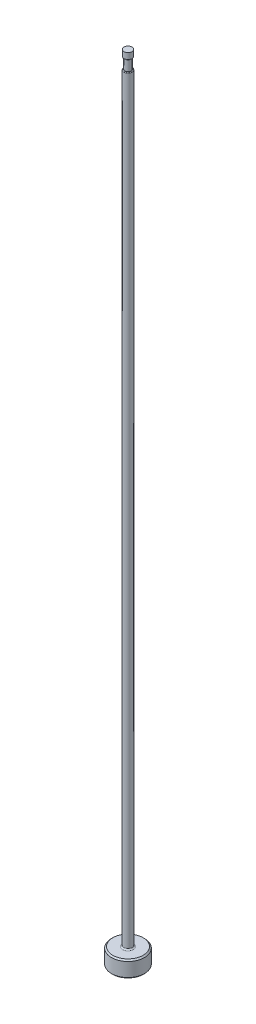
ISO-10303-21;
HEADER;
FILE_DESCRIPTION(('STEP AP214'),'2;1');
FILE_NAME('part.step','',(''),(''),'','','');
FILE_SCHEMA(('AUTOMOTIVE_DESIGN { 1 0 10303 214 1 1 1 1 }'));
ENDSEC;
DATA;
#1=APPLICATION_CONTEXT('core data for automotive mechanical design processes');
#2=APPLICATION_PROTOCOL_DEFINITION('international standard','automotive_design',2000,#1);
#3=PRODUCT_CONTEXT('',#1,'mechanical');
#4=PRODUCT('Part','Part','',(#3));
#5=PRODUCT_RELATED_PRODUCT_CATEGORY('part','',(#4));
#6=PRODUCT_DEFINITION_FORMATION('','',#4);
#7=PRODUCT_DEFINITION_CONTEXT('part definition',#1,'design');
#8=PRODUCT_DEFINITION('design','',#6,#7);
#9=PRODUCT_DEFINITION_SHAPE('','',#8);
#10=(LENGTH_UNIT() NAMED_UNIT(*) SI_UNIT(.MILLI.,.METRE.));
#11=(NAMED_UNIT(*) PLANE_ANGLE_UNIT() SI_UNIT($,.RADIAN.));
#12=(NAMED_UNIT(*) SI_UNIT($,.STERADIAN.) SOLID_ANGLE_UNIT());
#13=UNCERTAINTY_MEASURE_WITH_UNIT(LENGTH_MEASURE(1.E-05),#10,'distance_accuracy_value','');
#14=(GEOMETRIC_REPRESENTATION_CONTEXT(3) GLOBAL_UNCERTAINTY_ASSIGNED_CONTEXT((#13)) GLOBAL_UNIT_ASSIGNED_CONTEXT((#10,
#11,#12)) REPRESENTATION_CONTEXT('',''));
#15=CARTESIAN_POINT('',(0.,0.,0.));
#16=DIRECTION('',(0.,0.,1.));
#17=DIRECTION('',(1.,0.,0.));
#18=AXIS2_PLACEMENT_3D('',#15,#16,#17);
#19=CARTESIAN_POINT('',(-0.793749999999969,151.13,0.));
#20=DIRECTION('',(0.,1.,0.));
#21=DIRECTION('',(0.,0.,1.));
#22=AXIS2_PLACEMENT_3D('',#19,#20,#21);
#23=PLANE('',#22);
#24=CARTESIAN_POINT('',(0.,151.13,0.));
#25=DIRECTION('',(0.,1.,0.));
#26=DIRECTION('',(0.,0.,1.));
#27=AXIS2_PLACEMENT_3D('',#24,#25,#26);
#28=CIRCLE('',#27,0.647699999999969);
#29=CARTESIAN_POINT('',(0.,151.13,0.647699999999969));
#30=VERTEX_POINT('',#29);
#31=EDGE_CURVE('E11',#30,#30,#28,.F.);
#32=ORIENTED_EDGE('',*,*,#31,.T.);
#33=EDGE_LOOP('',(#32));
#34=FACE_BOUND('',#33,.T.);
#35=CARTESIAN_POINT('',(0.,151.13,0.));
#36=DIRECTION('',(0.,1.,0.));
#37=DIRECTION('',(0.,0.,1.));
#38=AXIS2_PLACEMENT_3D('',#35,#36,#37);
#39=CIRCLE('',#38,0.590549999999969);
#40=CARTESIAN_POINT('',(0.,151.13,0.590549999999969));
#41=VERTEX_POINT('',#40);
#42=EDGE_CURVE('E78',#41,#41,#39,.T.);
#43=ORIENTED_EDGE('',*,*,#42,.T.);
#44=EDGE_LOOP('',(#43));
#45=FACE_BOUND('',#44,.T.);
#46=ADVANCED_FACE('F36',(#34,#45),#23,.F.);
#47=CARTESIAN_POINT('',(0.,259.958771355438,0.));
#48=DIRECTION('',(0.,1.,0.));
#49=DIRECTION('',(0.,0.,1.));
#50=AXIS2_PLACEMENT_3D('',#47,#48,#49);
#51=CYLINDRICAL_SURFACE('',#50,0.793749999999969);
#52=DIRECTION('',(0.,1.,0.));
#53=VECTOR('',#52,1.);
#54=CARTESIAN_POINT('',(-0.590549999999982,259.958771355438,-0.530367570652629));
#55=LINE('',#54,#53);
#56=CARTESIAN_POINT('',(-0.590549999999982,148.971,-0.530367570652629));
#57=VERTEX_POINT('',#56);
#58=CARTESIAN_POINT('',(-0.590549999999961,86.614,-0.530367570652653));
#59=VERTEX_POINT('',#58);
#60=EDGE_CURVE('E73',#57,#59,#55,.F.);
#61=ORIENTED_EDGE('',*,*,#60,.F.);
#62=CARTESIAN_POINT('',(0.,148.971,0.));
#63=DIRECTION('',(0.,-1.,0.));
#64=DIRECTION('',(0.,0.,-1.));
#65=AXIS2_PLACEMENT_3D('',#62,#63,#64);
#66=CIRCLE('',#65,0.793749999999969);
#67=CARTESIAN_POINT('',(-0.590549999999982,148.971,0.530367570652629));
#68=VERTEX_POINT('',#67);
#69=EDGE_CURVE('E51',#57,#68,#66,.T.);
#70=ORIENTED_EDGE('',*,*,#69,.T.);
#71=DIRECTION('',(0.,1.,0.));
#72=VECTOR('',#71,1.);
#73=CARTESIAN_POINT('',(-0.590549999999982,259.958771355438,0.530367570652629));
#74=LINE('',#73,#72);
#75=CARTESIAN_POINT('',(-0.590549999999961,86.614,0.530367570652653));
#76=VERTEX_POINT('',#75);
#77=EDGE_CURVE('E84',#76,#68,#74,.T.);
#78=ORIENTED_EDGE('',*,*,#77,.F.);
#79=CARTESIAN_POINT('',(-0.590549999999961,86.614,-0.530367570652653));
#80=CARTESIAN_POINT('',(-0.59053917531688,86.5581966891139,-0.530314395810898));
#81=CARTESIAN_POINT('',(-0.592020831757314,86.5023728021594,-0.528725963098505));
#82=CARTESIAN_POINT('',(-0.597911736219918,86.3908205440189,-0.522091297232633));
#83=CARTESIAN_POINT('',(-0.602334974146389,86.3350939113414,-0.517028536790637));
#84=CARTESIAN_POINT('',(-0.614284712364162,86.2222022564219,-0.502771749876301));
#85=CARTESIAN_POINT('',(-0.621928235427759,86.1650688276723,-0.493420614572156));
#86=CARTESIAN_POINT('',(-0.640090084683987,86.0524288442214,-0.469629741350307));
#87=CARTESIAN_POINT('',(-0.650601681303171,85.9969188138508,-0.455201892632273));
#88=CARTESIAN_POINT('',(-0.672694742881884,85.8947751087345,-0.421752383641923));
#89=CARTESIAN_POINT('',(-0.684015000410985,85.8478538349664,-0.403447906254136));
#90=CARTESIAN_POINT('',(-0.707793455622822,85.7579254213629,-0.360113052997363));
#91=CARTESIAN_POINT('',(-0.720238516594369,85.7148824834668,-0.335155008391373));
#92=CARTESIAN_POINT('',(-0.738199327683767,85.6568429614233,-0.292081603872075));
#93=CARTESIAN_POINT('',(-0.743831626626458,85.6392421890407,-0.277537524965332));
#94=CARTESIAN_POINT('',(-0.754779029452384,85.6059385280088,-0.246220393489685));
#95=CARTESIAN_POINT('',(-0.760093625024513,85.5902386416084,-0.229443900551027));
#96=CARTESIAN_POINT('',(-0.770096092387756,85.5613279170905,-0.193256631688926));
#97=CARTESIAN_POINT('',(-0.774774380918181,85.5481541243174,-0.173812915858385));
#98=CARTESIAN_POINT('',(-0.782879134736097,85.525678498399,-0.132572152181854));
#99=CARTESIAN_POINT('',(-0.786309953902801,85.5163631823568,-0.110783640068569));
#100=CARTESIAN_POINT('',(-0.790553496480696,85.5049260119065,-0.0728220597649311));
#101=CARTESIAN_POINT('',(-0.791853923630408,85.5014525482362,-0.0571082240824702));
#102=CARTESIAN_POINT('',(-0.793506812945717,85.4970442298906,-0.02527858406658));
#103=CARTESIAN_POINT('',(-0.79385989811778,85.4961077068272,-0.00916305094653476));
#104=CARTESIAN_POINT('',(-0.79357975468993,85.4968527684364,0.0230049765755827));
#105=CARTESIAN_POINT('',(-0.792946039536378,85.4985356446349,0.0390574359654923));
#106=CARTESIAN_POINT('',(-0.790759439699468,85.5043804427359,0.0706385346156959));
#107=CARTESIAN_POINT('',(-0.789205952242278,85.5085439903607,0.086166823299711));
#108=CARTESIAN_POINT('',(-0.78484716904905,85.5203438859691,0.120053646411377));
#109=CARTESIAN_POINT('',(-0.781828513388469,85.5285809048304,0.138174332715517));
#110=CARTESIAN_POINT('',(-0.774926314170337,85.5477453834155,0.172744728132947));
#111=CARTESIAN_POINT('',(-0.77104126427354,85.5586775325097,0.189191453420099));
#112=CARTESIAN_POINT('',(-0.760742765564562,85.5882791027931,0.227766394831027));
#113=CARTESIAN_POINT('',(-0.754005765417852,85.6081551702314,0.248875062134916));
#114=CARTESIAN_POINT('',(-0.740079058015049,85.6508481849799,0.287657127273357));
#115=CARTESIAN_POINT('',(-0.732888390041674,85.6736714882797,0.305322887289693));
#116=CARTESIAN_POINT('',(-0.713188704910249,85.7390259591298,0.349810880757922));
#117=CARTESIAN_POINT('',(-0.700707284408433,85.7835752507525,0.373653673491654));
#118=CARTESIAN_POINT('',(-0.677153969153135,85.8759372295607,0.414797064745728));
#119=CARTESIAN_POINT('',(-0.666086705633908,85.9237598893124,0.432076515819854));
#120=CARTESIAN_POINT('',(-0.646811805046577,86.0171939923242,0.460367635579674));
#121=CARTESIAN_POINT('',(-0.638441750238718,86.0626519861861,0.4717848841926));
#122=CARTESIAN_POINT('',(-0.623612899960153,86.1546203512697,0.491217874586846));
#123=CARTESIAN_POINT('',(-0.617155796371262,86.2011316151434,0.499230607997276));
#124=CARTESIAN_POINT('',(-0.606291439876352,86.2947368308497,0.512368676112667));
#125=CARTESIAN_POINT('',(-0.601882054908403,86.3418301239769,0.517497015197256));
#126=CARTESIAN_POINT('',(-0.59516857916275,86.4363714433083,0.525204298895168));
#127=CARTESIAN_POINT('',(-0.592864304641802,86.4838194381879,0.527783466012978));
#128=CARTESIAN_POINT('',(-0.591267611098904,86.5451029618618,0.529567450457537));
#129=CARTESIAN_POINT('',(-0.590998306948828,86.5588916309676,0.52986795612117));
#130=CARTESIAN_POINT('',(-0.590639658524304,86.586453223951,0.530267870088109));
#131=CARTESIAN_POINT('',(-0.59055004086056,86.6002261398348,0.530367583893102));
#132=CARTESIAN_POINT('',(-0.59054999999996,86.6139999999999,0.530367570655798));
#133=B_SPLINE_CURVE_WITH_KNOTS('',3,(#79,#80,#81,#82,#83,#84,#85,#86,#87,#88,#89,#90,#91,#92,
#93,#94,#95,#96,#97,#98,#99,#100,#101,#102,#103,#104,#105,#106,#107,#108,#109,#110,#111,#112,
#113,#114,#115,#116,#117,#118,#119,#120,#121,#122,#123,#124,#125,#126,#127,#128,#129,#130,#131,
#132),.UNSPECIFIED.,.F.,.F.,(4,2,2,2,2,2,2,2,2,2,2,2,2,2,2,2,2,2,2,2,2,2,2,2,2,2,4),(0.,
0.167401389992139,0.335604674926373,0.510534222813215,0.68505679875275,0.839551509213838,
0.992430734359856,1.0628421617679,1.13336338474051,1.20485071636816,1.27608609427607,
1.32431373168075,1.3725096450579,1.42072932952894,1.46898064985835,1.52904518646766,
1.5892149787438,1.67801053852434,1.76700089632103,1.92226871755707,2.0780326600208,
2.22066560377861,2.3634243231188,2.50603406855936,2.6486313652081,2.69001340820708,
2.73133244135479),.UNSPECIFIED.);
#134=EDGE_CURVE('E81',#59,#76,#133,.T.);
#135=ORIENTED_EDGE('',*,*,#134,.F.);
#136=EDGE_LOOP('',(#61,#70,#78,#135));
#137=FACE_BOUND('',#136,.T.);
#138=CARTESIAN_POINT('',(0.,3.42900000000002,0.));
#139=DIRECTION('',(0.,1.,0.));
#140=DIRECTION('',(0.,0.,1.));
#141=AXIS2_PLACEMENT_3D('',#138,#139,#140);
#142=CIRCLE('',#141,0.793749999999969);
#143=CARTESIAN_POINT('',(0.,3.42900000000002,0.793749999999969));
#144=VERTEX_POINT('',#143);
#145=EDGE_CURVE('E116',#144,#144,#142,.T.);
#146=ORIENTED_EDGE('',*,*,#145,.T.);
#147=EDGE_LOOP('',(#146));
#148=FACE_BOUND('',#147,.T.);
#149=ADVANCED_FACE('F82',(#137,#148),#51,.T.);
#150=CARTESIAN_POINT('',(0.,0.,0.));
#151=DIRECTION('',(0.,-1.,0.));
#152=DIRECTION('',(0.,0.,-1.));
#153=AXIS2_PLACEMENT_3D('',#150,#151,#152);
#154=PLANE('',#153);
#155=CARTESIAN_POINT('',(0.,0.,0.));
#156=DIRECTION('',(0.,-1.,0.));
#157=DIRECTION('',(0.,0.,-1.));
#158=AXIS2_PLACEMENT_3D('',#155,#156,#157);
#159=CIRCLE('',#158,2.92099999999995);
#160=CARTESIAN_POINT('',(0.,0.,-2.92099999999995));
#161=VERTEX_POINT('',#160);
#162=EDGE_CURVE('E113',#161,#161,#159,.T.);
#163=ORIENTED_EDGE('',*,*,#162,.T.);
#164=EDGE_LOOP('',(#163));
#165=FACE_BOUND('',#164,.T.);
#166=ADVANCED_FACE('F192',(#165),#154,.T.);
#167=CARTESIAN_POINT('',(0.,259.958771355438,0.));
#168=DIRECTION('',(0.,1.,0.));
#169=DIRECTION('',(0.,0.,1.));
#170=AXIS2_PLACEMENT_3D('',#167,#168,#169);
#171=CYLINDRICAL_SURFACE('',#170,3.17499999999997);
#172=CARTESIAN_POINT('',(0.,2.92100000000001,0.));
#173=DIRECTION('',(0.,1.,0.));
#174=DIRECTION('',(0.,0.,1.));
#175=AXIS2_PLACEMENT_3D('',#172,#173,#174);
#176=CIRCLE('',#175,3.17499999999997);
#177=CARTESIAN_POINT('',(0.,2.92100000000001,3.17499999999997));
#178=VERTEX_POINT('',#177);
#179=EDGE_CURVE('E110',#178,#178,#176,.F.);
#180=ORIENTED_EDGE('',*,*,#179,.T.);
#181=EDGE_LOOP('',(#180));
#182=FACE_BOUND('',#181,.T.);
#183=CARTESIAN_POINT('',(0.,0.254000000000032,0.));
#184=DIRECTION('',(0.,-1.,0.));
#185=DIRECTION('',(0.,0.,-1.));
#186=AXIS2_PLACEMENT_3D('',#183,#184,#185);
#187=CIRCLE('',#186,3.17499999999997);
#188=CARTESIAN_POINT('',(0.,0.254000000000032,-3.17499999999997));
#189=VERTEX_POINT('',#188);
#190=EDGE_CURVE('E107',#189,#189,#187,.F.);
#191=ORIENTED_EDGE('',*,*,#190,.T.);
#192=EDGE_LOOP('',(#191));
#193=FACE_BOUND('',#192,.T.);
#194=ADVANCED_FACE('F195',(#182,#193),#171,.T.);
#195=CARTESIAN_POINT('',(-3.17499999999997,3.175,0.));
#196=DIRECTION('',(0.,1.,0.));
#197=DIRECTION('',(0.,0.,1.));
#198=AXIS2_PLACEMENT_3D('',#195,#196,#197);
#199=PLANE('',#198);
#200=CARTESIAN_POINT('',(0.,3.175,0.));
#201=DIRECTION('',(0.,1.,0.));
#202=DIRECTION('',(0.,0.,1.));
#203=AXIS2_PLACEMENT_3D('',#200,#201,#202);
#204=CIRCLE('',#203,1.04774999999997);
#205=CARTESIAN_POINT('',(0.,3.175,1.04774999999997));
#206=VERTEX_POINT('',#205);
#207=EDGE_CURVE('E87',#206,#206,#204,.F.);
#208=ORIENTED_EDGE('',*,*,#207,.T.);
#209=EDGE_LOOP('',(#208));
#210=FACE_BOUND('',#209,.T.);
#211=CARTESIAN_POINT('',(0.,3.175,0.));
#212=DIRECTION('',(0.,1.,0.));
#213=DIRECTION('',(0.,0.,1.));
#214=AXIS2_PLACEMENT_3D('',#211,#212,#213);
#215=CIRCLE('',#214,2.92099999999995);
#216=CARTESIAN_POINT('',(0.,3.175,2.92099999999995));
#217=VERTEX_POINT('',#216);
#218=EDGE_CURVE('E104',#217,#217,#215,.T.);
#219=ORIENTED_EDGE('',*,*,#218,.T.);
#220=EDGE_LOOP('',(#219));
#221=FACE_BOUND('',#220,.T.);
#222=ADVANCED_FACE('F190',(#210,#221),#199,.T.);
#223=CARTESIAN_POINT('',(0.,3.17499999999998,0.));
#224=DIRECTION('',(0.,-1.,0.));
#225=DIRECTION('',(0.,0.,-1.));
#226=AXIS2_PLACEMENT_3D('',#223,#224,#225);
#227=CONICAL_SURFACE('',#226,2.92099999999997,0.7853981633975);
#228=ORIENTED_EDGE('',*,*,#179,.F.);
#229=EDGE_LOOP('',(#228));
#230=FACE_BOUND('',#229,.T.);
#231=ORIENTED_EDGE('',*,*,#218,.F.);
#232=EDGE_LOOP('',(#231));
#233=FACE_BOUND('',#232,.T.);
#234=ADVANCED_FACE('F186',(#230,#233),#227,.T.);
#235=CARTESIAN_POINT('',(0.,0.254000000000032,0.));
#236=DIRECTION('',(0.,1.,0.));
#237=DIRECTION('',(0.,0.,1.));
#238=AXIS2_PLACEMENT_3D('',#235,#236,#237);
#239=CONICAL_SURFACE('',#238,3.17499999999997,0.785398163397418);
#240=ORIENTED_EDGE('',*,*,#162,.F.);
#241=EDGE_LOOP('',(#240));
#242=FACE_BOUND('',#241,.T.);
#243=ORIENTED_EDGE('',*,*,#190,.F.);
#244=EDGE_LOOP('',(#243));
#245=FACE_BOUND('',#244,.T.);
#246=ADVANCED_FACE('F182',(#242,#245),#239,.T.);
#247=CARTESIAN_POINT('',(0.,3.42900000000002,0.));
#248=DIRECTION('',(0.,1.,0.));
#249=DIRECTION('',(0.,0.,1.));
#250=AXIS2_PLACEMENT_3D('',#247,#248,#249);
#251=TOROIDAL_SURFACE('',#250,1.04774999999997,0.254);
#252=ORIENTED_EDGE('',*,*,#207,.F.);
#253=EDGE_LOOP('',(#252));
#254=FACE_BOUND('',#253,.T.);
#255=ORIENTED_EDGE('',*,*,#145,.F.);
#256=EDGE_LOOP('',(#255));
#257=FACE_BOUND('',#256,.T.);
#258=ADVANCED_FACE('F147',(#254,#257),#251,.F.);
#259=CARTESIAN_POINT('',(-0.793749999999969,149.098,0.));
#260=DIRECTION('',(0.,-1.,0.));
#261=DIRECTION('',(0.,0.,-1.));
#262=AXIS2_PLACEMENT_3D('',#259,#260,#261);
#263=PLANE('',#262);
#264=DIRECTION('',(0.,0.,1.));
#265=VECTOR('',#264,1.);
#266=CARTESIAN_POINT('',(-0.590549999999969,149.098,0.));
#267=LINE('',#266,#265);
#268=CARTESIAN_POINT('',(-0.590549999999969,149.098,0.));
#269=VERTEX_POINT('',#268);
#270=CARTESIAN_POINT('',(-0.590549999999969,149.098,0.309525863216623));
#271=VERTEX_POINT('',#270);
#272=EDGE_CURVE('E90',#269,#271,#267,.T.);
#273=ORIENTED_EDGE('',*,*,#272,.T.);
#274=CARTESIAN_POINT('',(0.,149.098,0.));
#275=DIRECTION('',(0.,-1.,0.));
#276=DIRECTION('',(0.,0.,-1.));
#277=AXIS2_PLACEMENT_3D('',#274,#275,#276);
#278=CIRCLE('',#277,0.666749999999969);
#279=CARTESIAN_POINT('',(-0.590549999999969,149.098,-0.309525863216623));
#280=VERTEX_POINT('',#279);
#281=EDGE_CURVE('E86',#271,#280,#278,.F.);
#282=ORIENTED_EDGE('',*,*,#281,.T.);
#283=EDGE_CURVE('E79',#280,#269,#267,.T.);
#284=ORIENTED_EDGE('',*,*,#283,.T.);
#285=CARTESIAN_POINT('',(0.,149.098,0.));
#286=DIRECTION('',(0.,1.,0.));
#287=DIRECTION('',(0.,0.,1.));
#288=AXIS2_PLACEMENT_3D('',#285,#286,#287);
#289=CIRCLE('',#288,0.590549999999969);
#290=EDGE_CURVE('E101',#269,#269,#289,.T.);
#291=ORIENTED_EDGE('',*,*,#290,.F.);
#292=EDGE_LOOP('',(#273,#282,#284,#291));
#293=FACE_BOUND('',#292,.T.);
#294=ADVANCED_FACE('F144',(#293),#263,.F.);
#295=CARTESIAN_POINT('',(0.,153.448281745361,0.));
#296=DIRECTION('',(0.,1.,0.));
#297=DIRECTION('',(0.,0.,1.));
#298=AXIS2_PLACEMENT_3D('',#295,#296,#297);
#299=CYLINDRICAL_SURFACE('',#298,0.590549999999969);
#300=ORIENTED_EDGE('',*,*,#42,.F.);
#301=EDGE_LOOP('',(#300));
#302=FACE_BOUND('',#301,.T.);
#303=ORIENTED_EDGE('',*,*,#290,.T.);
#304=EDGE_LOOP('',(#303));
#305=FACE_BOUND('',#304,.T.);
#306=ADVANCED_FACE('F141',(#302,#305),#299,.T.);
#307=CARTESIAN_POINT('',(-0.590549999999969,150.114,-3.17499999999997));
#308=DIRECTION('',(1.,0.,0.));
#309=DIRECTION('',(0.,1.,0.));
#310=AXIS2_PLACEMENT_3D('',#307,#308,#309);
#311=PLANE('',#310);
#312=ORIENTED_EDGE('',*,*,#283,.F.);
#313=CARTESIAN_POINT('',(-0.590549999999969,149.098,-0.309525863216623));
#314=CARTESIAN_POINT('',(-0.590549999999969,149.097996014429,-0.320154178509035));
#315=CARTESIAN_POINT('',(-0.590549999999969,149.097711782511,-0.330794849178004));
#316=CARTESIAN_POINT('',(-0.590549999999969,149.096412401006,-0.352104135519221));
#317=CARTESIAN_POINT('',(-0.590549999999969,149.095392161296,-0.362772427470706));
#318=CARTESIAN_POINT('',(-0.590549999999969,149.092423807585,-0.384147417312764));
#319=CARTESIAN_POINT('',(-0.590549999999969,149.090462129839,-0.394852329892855));
#320=CARTESIAN_POINT('',(-0.590549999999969,149.085396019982,-0.415965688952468));
#321=CARTESIAN_POINT('',(-0.590549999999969,149.08229522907,-0.426374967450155));
#322=CARTESIAN_POINT('',(-0.590549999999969,149.075886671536,-0.443512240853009));
#323=CARTESIAN_POINT('',(-0.590549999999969,149.072944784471,-0.450376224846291));
#324=CARTESIAN_POINT('',(-0.590549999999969,149.066316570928,-0.463725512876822));
#325=CARTESIAN_POINT('',(-0.590549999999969,149.062631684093,-0.470211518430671));
#326=CARTESIAN_POINT('',(-0.590549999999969,149.054387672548,-0.482700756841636));
#327=CARTESIAN_POINT('',(-0.590549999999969,149.049820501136,-0.488698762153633));
#328=CARTESIAN_POINT('',(-0.590549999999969,149.039766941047,-0.499879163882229));
#329=CARTESIAN_POINT('',(-0.590549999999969,149.034281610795,-0.505062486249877));
#330=CARTESIAN_POINT('',(-0.590549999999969,149.024008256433,-0.513019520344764));
#331=CARTESIAN_POINT('',(-0.590549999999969,149.019432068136,-0.5160659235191));
#332=CARTESIAN_POINT('',(-0.590549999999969,149.009852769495,-0.521376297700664));
#333=CARTESIAN_POINT('',(-0.590549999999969,149.004850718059,-0.523642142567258));
#334=CARTESIAN_POINT('',(-0.590549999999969,148.995098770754,-0.527042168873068));
#335=CARTESIAN_POINT('',(-0.590549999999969,148.990383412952,-0.528274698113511));
#336=CARTESIAN_POINT('',(-0.590549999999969,148.98078232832,-0.52994444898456));
#337=CARTESIAN_POINT('',(-0.590549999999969,148.97589566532,-0.530376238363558));
#338=CARTESIAN_POINT('',(-0.590549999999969,148.971,-0.530367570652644));
#339=B_SPLINE_CURVE_WITH_KNOTS('',3,(#313,#314,#315,#316,#317,#318,#319,#320,#321,#322,#323,
#324,#325,#326,#327,#328,#329,#330,#331,#332,#333,#334,#335,#336,#337,#338),.UNSPECIFIED.,.F.,
.F.,(4,2,2,2,2,2,2,2,2,2,2,2,4),(0.,0.0319002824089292,0.0640233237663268,0.0966237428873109,
0.129120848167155,0.151487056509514,0.173810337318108,0.196347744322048,0.218859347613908,
0.235290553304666,0.251682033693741,0.266237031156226,0.280890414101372),.UNSPECIFIED.);
#340=EDGE_CURVE('E59',#280,#57,#339,.T.);
#341=ORIENTED_EDGE('',*,*,#340,.T.);
#342=ORIENTED_EDGE('',*,*,#60,.T.);
#343=DIRECTION('',(0.,0.,1.));
#344=VECTOR('',#343,1.);
#345=CARTESIAN_POINT('',(-0.590549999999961,86.614,-3.17499999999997));
#346=LINE('',#345,#344);
#347=EDGE_CURVE('E77',#59,#76,#346,.T.);
#348=ORIENTED_EDGE('',*,*,#347,.T.);
#349=ORIENTED_EDGE('',*,*,#77,.T.);
#350=CARTESIAN_POINT('',(-0.590549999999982,148.971,0.530367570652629));
#351=CARTESIAN_POINT('',(-0.590549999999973,148.976430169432,0.530380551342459));
#352=CARTESIAN_POINT('',(-0.59054999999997,148.981846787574,0.529847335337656));
#353=CARTESIAN_POINT('',(-0.590549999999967,148.992444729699,0.527800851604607));
#354=CARTESIAN_POINT('',(-0.590549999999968,148.997627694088,0.526296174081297));
#355=CARTESIAN_POINT('',(-0.590549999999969,149.007636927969,0.522420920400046));
#356=CARTESIAN_POINT('',(-0.590549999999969,149.012464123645,0.520052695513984));
#357=CARTESIAN_POINT('',(-0.590549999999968,149.021699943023,0.514595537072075));
#358=CARTESIAN_POINT('',(-0.590549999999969,149.026107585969,0.511504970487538));
#359=CARTESIAN_POINT('',(-0.590549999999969,149.036154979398,0.503374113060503));
#360=CARTESIAN_POINT('',(-0.590549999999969,149.041566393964,0.498052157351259));
#361=CARTESIAN_POINT('',(-0.590549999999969,149.05146695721,0.486619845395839));
#362=CARTESIAN_POINT('',(-0.590549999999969,149.055954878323,0.480508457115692));
#363=CARTESIAN_POINT('',(-0.590549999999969,149.066155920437,0.464496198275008));
#364=CARTESIAN_POINT('',(-0.590549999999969,149.071326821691,0.454252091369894));
#365=CARTESIAN_POINT('',(-0.590549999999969,149.08006747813,0.433065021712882));
#366=CARTESIAN_POINT('',(-0.590549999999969,149.083627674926,0.422118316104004));
#367=CARTESIAN_POINT('',(-0.590549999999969,149.090882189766,0.3943269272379));
#368=CARTESIAN_POINT('',(-0.590549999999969,149.093749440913,0.377275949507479));
#369=CARTESIAN_POINT('',(-0.590549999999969,149.097271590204,0.343282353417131));
#370=CARTESIAN_POINT('',(-0.590549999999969,149.097970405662,0.326344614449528));
#371=CARTESIAN_POINT('',(-0.590549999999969,149.098,0.309525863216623));
#372=B_SPLINE_CURVE_WITH_KNOTS('',3,(#350,#351,#352,#353,#354,#355,#356,#357,#358,#359,#360,
#361,#362,#363,#364,#365,#366,#367,#368,#369,#370,#371),.UNSPECIFIED.,.F.,.F.,(4,2,2,2,2,2,2,2,
2,2,4),(0.,0.0162429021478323,0.0323441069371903,0.0484017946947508,0.0644961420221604,
0.0871387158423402,0.109811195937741,0.144045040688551,0.178479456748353,0.230172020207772,
0.280810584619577),.UNSPECIFIED.);
#373=EDGE_CURVE('E172',#68,#271,#372,.T.);
#374=ORIENTED_EDGE('',*,*,#373,.T.);
#375=ORIENTED_EDGE('',*,*,#272,.F.);
#376=EDGE_LOOP('',(#312,#341,#342,#348,#349,#374,#375));
#377=FACE_BOUND('',#376,.T.);
#378=ADVANCED_FACE('F75',(#377),#311,.F.);
#379=CARTESIAN_POINT('',(-3.76554999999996,86.614,-3.17499999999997));
#380=DIRECTION('',(0.,0.,1.));
#381=DIRECTION('',(1.,0.,0.));
#382=AXIS2_PLACEMENT_3D('',#379,#380,#381);
#383=CYLINDRICAL_SURFACE('',#382,3.175);
#384=ORIENTED_EDGE('',*,*,#347,.F.);
#385=ORIENTED_EDGE('',*,*,#134,.T.);
#386=EDGE_LOOP('',(#384,#385));
#387=FACE_BOUND('',#386,.T.);
#388=ADVANCED_FACE('F89',(#387),#383,.F.);
#389=CARTESIAN_POINT('',(0.,152.687735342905,0.));
#390=DIRECTION('',(0.,1.,0.));
#391=DIRECTION('',(0.,0.,1.));
#392=AXIS2_PLACEMENT_3D('',#389,#390,#391);
#393=CYLINDRICAL_SURFACE('',#392,0.774699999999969);
#394=CARTESIAN_POINT('',(0.,151.257,0.));
#395=DIRECTION('',(0.,1.,0.));
#396=DIRECTION('',(0.,0.,1.));
#397=AXIS2_PLACEMENT_3D('',#394,#395,#396);
#398=CIRCLE('',#397,0.774699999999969);
#399=CARTESIAN_POINT('',(0.,151.257,0.774699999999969));
#400=VERTEX_POINT('',#399);
#401=EDGE_CURVE('E44',#400,#400,#398,.T.);
#402=ORIENTED_EDGE('',*,*,#401,.T.);
#403=EDGE_LOOP('',(#402));
#404=FACE_BOUND('',#403,.T.);
#405=CARTESIAN_POINT('',(0.,152.4,0.));
#406=DIRECTION('',(0.,1.,0.));
#407=DIRECTION('',(0.,0.,1.));
#408=AXIS2_PLACEMENT_3D('',#405,#406,#407);
#409=CIRCLE('',#408,0.774699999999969);
#410=CARTESIAN_POINT('',(0.,152.4,0.774699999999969));
#411=VERTEX_POINT('',#410);
#412=EDGE_CURVE('E91',#411,#411,#409,.T.);
#413=ORIENTED_EDGE('',*,*,#412,.F.);
#414=EDGE_LOOP('',(#413));
#415=FACE_BOUND('',#414,.T.);
#416=ADVANCED_FACE('F135',(#404,#415),#393,.T.);
#417=CARTESIAN_POINT('',(-0.793749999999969,152.4,0.));
#418=DIRECTION('',(0.,1.,0.));
#419=DIRECTION('',(0.,0.,1.));
#420=AXIS2_PLACEMENT_3D('',#417,#418,#419);
#421=PLANE('',#420);
#422=ORIENTED_EDGE('',*,*,#412,.T.);
#423=EDGE_LOOP('',(#422));
#424=FACE_BOUND('',#423,.T.);
#425=ADVANCED_FACE('F149',(#424),#421,.T.);
#426=CARTESIAN_POINT('',(0.,148.971,0.));
#427=DIRECTION('',(0.,-1.,0.));
#428=DIRECTION('',(0.,0.,-1.));
#429=AXIS2_PLACEMENT_3D('',#426,#427,#428);
#430=TOROIDAL_SURFACE('',#429,0.666749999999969,0.127);
#431=ORIENTED_EDGE('',*,*,#373,.F.);
#432=ORIENTED_EDGE('',*,*,#69,.F.);
#433=ORIENTED_EDGE('',*,*,#340,.F.);
#434=ORIENTED_EDGE('',*,*,#281,.F.);
#435=EDGE_LOOP('',(#431,#432,#433,#434));
#436=FACE_BOUND('',#435,.T.);
#437=ADVANCED_FACE('F151',(#436),#430,.T.);
#438=CARTESIAN_POINT('',(0.,151.257,0.));
#439=DIRECTION('',(0.,1.,0.));
#440=DIRECTION('',(0.,0.,1.));
#441=AXIS2_PLACEMENT_3D('',#438,#439,#440);
#442=TOROIDAL_SURFACE('',#441,0.647699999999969,0.127);
#443=ORIENTED_EDGE('',*,*,#31,.F.);
#444=EDGE_LOOP('',(#443));
#445=FACE_BOUND('',#444,.T.);
#446=ORIENTED_EDGE('',*,*,#401,.F.);
#447=EDGE_LOOP('',(#446));
#448=FACE_BOUND('',#447,.T.);
#449=ADVANCED_FACE('F38',(#445,#448),#442,.T.);
#450=CLOSED_SHELL('',(#46,#149,#166,#194,#222,#234,#246,#258,#294,#306,#378,#388,#416,#425,#437,#449));
#451=MANIFOLD_SOLID_BREP('B2',#450);
#452=ADVANCED_BREP_SHAPE_REPRESENTATION('',(#18,#451),#14);
#453=SHAPE_DEFINITION_REPRESENTATION(#9,#452);
ENDSEC;
END-ISO-10303-21;
